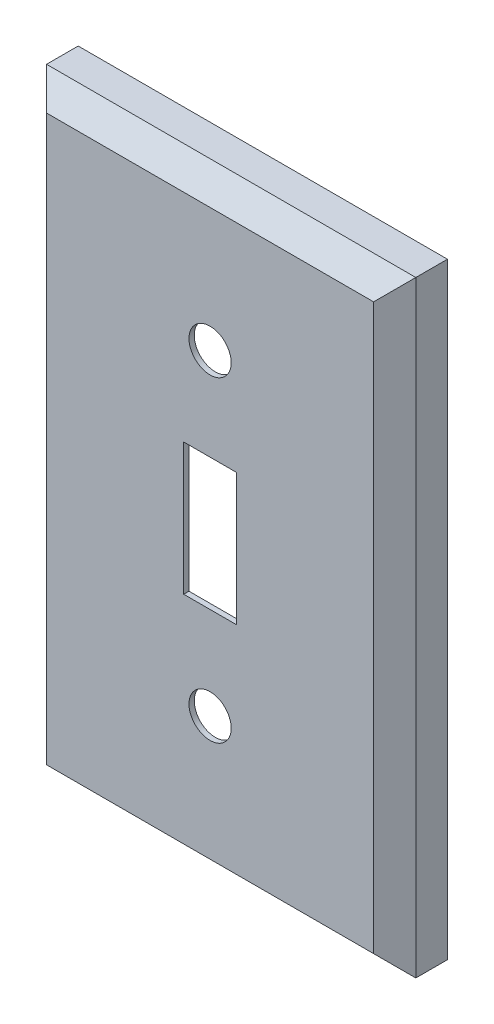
ISO-10303-21;
HEADER;
FILE_DESCRIPTION(('STEP AP214'),'2;1');
FILE_NAME('part.step','',(''),(''),'','','');
FILE_SCHEMA(('AUTOMOTIVE_DESIGN { 1 0 10303 214 1 1 1 1 }'));
ENDSEC;
DATA;
#1=APPLICATION_CONTEXT('core data for automotive mechanical design processes');
#2=APPLICATION_PROTOCOL_DEFINITION('international standard','automotive_design',2000,#1);
#3=PRODUCT_CONTEXT('',#1,'mechanical');
#4=PRODUCT('Part','Part','',(#3));
#5=PRODUCT_RELATED_PRODUCT_CATEGORY('part','',(#4));
#6=PRODUCT_DEFINITION_FORMATION('','',#4);
#7=PRODUCT_DEFINITION_CONTEXT('part definition',#1,'design');
#8=PRODUCT_DEFINITION('design','',#6,#7);
#9=PRODUCT_DEFINITION_SHAPE('','',#8);
#10=(LENGTH_UNIT() NAMED_UNIT(*) SI_UNIT(.MILLI.,.METRE.));
#11=(NAMED_UNIT(*) PLANE_ANGLE_UNIT() SI_UNIT($,.RADIAN.));
#12=(NAMED_UNIT(*) SI_UNIT($,.STERADIAN.) SOLID_ANGLE_UNIT());
#13=UNCERTAINTY_MEASURE_WITH_UNIT(LENGTH_MEASURE(1.E-05),#10,'distance_accuracy_value','');
#14=(GEOMETRIC_REPRESENTATION_CONTEXT(3) GLOBAL_UNCERTAINTY_ASSIGNED_CONTEXT((#13)) GLOBAL_UNIT_ASSIGNED_CONTEXT((#10,
#11,#12)) REPRESENTATION_CONTEXT('',''));
#15=CARTESIAN_POINT('',(0.,0.,0.));
#16=DIRECTION('',(0.,0.,1.));
#17=DIRECTION('',(1.,0.,0.));
#18=AXIS2_PLACEMENT_3D('',#15,#16,#17);
#19=CARTESIAN_POINT('',(0.,115.,0.));
#20=DIRECTION('',(0.,0.,-1.));
#21=DIRECTION('',(-1.,0.,0.));
#22=AXIS2_PLACEMENT_3D('',#19,#20,#21);
#23=PLANE('',#22);
#24=DIRECTION('',(0.,-1.,0.));
#25=VECTOR('',#24,1.);
#26=CARTESIAN_POINT('',(0.,0.,0.));
#27=LINE('',#26,#25);
#28=CARTESIAN_POINT('',(0.,115.,0.));
#29=VERTEX_POINT('',#28);
#30=CARTESIAN_POINT('',(0.,0.,0.));
#31=VERTEX_POINT('',#30);
#32=EDGE_CURVE('E229',#29,#31,#27,.T.);
#33=ORIENTED_EDGE('',*,*,#32,.F.);
#34=DIRECTION('',(-1.,0.,0.));
#35=VECTOR('',#34,1.);
#36=CARTESIAN_POINT('',(0.,115.,0.));
#37=LINE('',#36,#35);
#38=CARTESIAN_POINT('',(70.,115.,0.));
#39=VERTEX_POINT('',#38);
#40=EDGE_CURVE('E239',#39,#29,#37,.T.);
#41=ORIENTED_EDGE('',*,*,#40,.F.);
#42=DIRECTION('',(0.,1.,0.));
#43=VECTOR('',#42,1.);
#44=CARTESIAN_POINT('',(70.,0.,0.));
#45=LINE('',#44,#43);
#46=CARTESIAN_POINT('',(70.,0.,0.));
#47=VERTEX_POINT('',#46);
#48=EDGE_CURVE('E236',#47,#39,#45,.T.);
#49=ORIENTED_EDGE('',*,*,#48,.F.);
#50=DIRECTION('',(1.,0.,0.));
#51=VECTOR('',#50,1.);
#52=CARTESIAN_POINT('',(0.,0.,0.));
#53=LINE('',#52,#51);
#54=EDGE_CURVE('E232',#31,#47,#53,.T.);
#55=ORIENTED_EDGE('',*,*,#54,.F.);
#56=EDGE_LOOP('',(#33,#41,#49,#55));
#57=FACE_BOUND('',#56,.T.);
#58=DIRECTION('',(-1.,0.,0.));
#59=VECTOR('',#58,1.);
#60=CARTESIAN_POINT('',(0.,114.,0.));
#61=LINE('',#60,#59);
#62=CARTESIAN_POINT('',(69.,114.,0.));
#63=VERTEX_POINT('',#62);
#64=CARTESIAN_POINT('',(1.,114.,0.));
#65=VERTEX_POINT('',#64);
#66=EDGE_CURVE('E191',#63,#65,#61,.T.);
#67=ORIENTED_EDGE('',*,*,#66,.T.);
#68=DIRECTION('',(0.,-1.,0.));
#69=VECTOR('',#68,1.);
#70=CARTESIAN_POINT('',(1.,115.,0.));
#71=LINE('',#70,#69);
#72=CARTESIAN_POINT('',(1.,1.,0.));
#73=VERTEX_POINT('',#72);
#74=EDGE_CURVE('E205',#65,#73,#71,.T.);
#75=ORIENTED_EDGE('',*,*,#74,.T.);
#76=DIRECTION('',(1.,0.,0.));
#77=VECTOR('',#76,1.);
#78=CARTESIAN_POINT('',(0.,1.,0.));
#79=LINE('',#78,#77);
#80=CARTESIAN_POINT('',(69.,1.,0.));
#81=VERTEX_POINT('',#80);
#82=EDGE_CURVE('E221',#73,#81,#79,.T.);
#83=ORIENTED_EDGE('',*,*,#82,.T.);
#84=DIRECTION('',(0.,1.,0.));
#85=VECTOR('',#84,1.);
#86=CARTESIAN_POINT('',(69.,115.,0.));
#87=LINE('',#86,#85);
#88=EDGE_CURVE('E224',#81,#63,#87,.T.);
#89=ORIENTED_EDGE('',*,*,#88,.T.);
#90=EDGE_LOOP('',(#67,#75,#83,#89));
#91=FACE_BOUND('',#90,.T.);
#92=ADVANCED_FACE('F32',(#57,#91),#23,.T.);
#93=CARTESIAN_POINT('',(0.,0.,10.));
#94=DIRECTION('',(1.,0.,0.));
#95=DIRECTION('',(0.,0.,-1.));
#96=AXIS2_PLACEMENT_3D('',#93,#94,#95);
#97=PLANE('',#96);
#98=DIRECTION('',(0.,0.,-1.));
#99=VECTOR('',#98,1.);
#100=CARTESIAN_POINT('',(0.,0.,10.));
#101=LINE('',#100,#99);
#102=CARTESIAN_POINT('',(0.,0.,5.99999999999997));
#103=VERTEX_POINT('',#102);
#104=EDGE_CURVE('E248',#103,#31,#101,.T.);
#105=ORIENTED_EDGE('',*,*,#104,.F.);
#106=DIRECTION('',(0.,1.,0.));
#107=VECTOR('',#106,1.);
#108=CARTESIAN_POINT('',(0.,0.,5.99999999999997));
#109=LINE('',#108,#107);
#110=CARTESIAN_POINT('',(0.,115.,5.99999999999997));
#111=VERTEX_POINT('',#110);
#112=EDGE_CURVE('E266',#103,#111,#109,.T.);
#113=ORIENTED_EDGE('',*,*,#112,.T.);
#114=DIRECTION('',(0.,0.,-1.));
#115=VECTOR('',#114,1.);
#116=CARTESIAN_POINT('',(0.,115.,10.));
#117=LINE('',#116,#115);
#118=EDGE_CURVE('E242',#111,#29,#117,.T.);
#119=ORIENTED_EDGE('',*,*,#118,.T.);
#120=ORIENTED_EDGE('',*,*,#32,.T.);
#121=EDGE_LOOP('',(#105,#113,#119,#120));
#122=FACE_BOUND('',#121,.T.);
#123=ADVANCED_FACE('F298',(#122),#97,.F.);
#124=CARTESIAN_POINT('',(0.,0.,10.));
#125=DIRECTION('',(0.,1.,0.));
#126=DIRECTION('',(0.,0.,1.));
#127=AXIS2_PLACEMENT_3D('',#124,#125,#126);
#128=PLANE('',#127);
#129=DIRECTION('',(0.,0.,-1.));
#130=VECTOR('',#129,1.);
#131=CARTESIAN_POINT('',(70.,0.,10.));
#132=LINE('',#131,#130);
#133=CARTESIAN_POINT('',(70.,0.,5.99999999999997));
#134=VERTEX_POINT('',#133);
#135=EDGE_CURVE('E246',#134,#47,#132,.T.);
#136=ORIENTED_EDGE('',*,*,#135,.F.);
#137=DIRECTION('',(-1.,0.,0.));
#138=VECTOR('',#137,1.);
#139=CARTESIAN_POINT('',(0.,0.,5.99999999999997));
#140=LINE('',#139,#138);
#141=EDGE_CURVE('E264',#134,#103,#140,.T.);
#142=ORIENTED_EDGE('',*,*,#141,.T.);
#143=ORIENTED_EDGE('',*,*,#104,.T.);
#144=ORIENTED_EDGE('',*,*,#54,.T.);
#145=EDGE_LOOP('',(#136,#142,#143,#144));
#146=FACE_BOUND('',#145,.T.);
#147=ADVANCED_FACE('F304',(#146),#128,.F.);
#148=CARTESIAN_POINT('',(70.,0.,10.));
#149=DIRECTION('',(-1.,0.,0.));
#150=DIRECTION('',(0.,0.,1.));
#151=AXIS2_PLACEMENT_3D('',#148,#149,#150);
#152=PLANE('',#151);
#153=DIRECTION('',(0.,0.,-1.));
#154=VECTOR('',#153,1.);
#155=CARTESIAN_POINT('',(70.,115.,10.));
#156=LINE('',#155,#154);
#157=CARTESIAN_POINT('',(70.,115.,5.99999999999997));
#158=VERTEX_POINT('',#157);
#159=EDGE_CURVE('E244',#158,#39,#156,.T.);
#160=ORIENTED_EDGE('',*,*,#159,.F.);
#161=DIRECTION('',(0.,-1.,0.));
#162=VECTOR('',#161,1.);
#163=CARTESIAN_POINT('',(70.,0.,5.99999999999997));
#164=LINE('',#163,#162);
#165=EDGE_CURVE('E262',#158,#134,#164,.T.);
#166=ORIENTED_EDGE('',*,*,#165,.T.);
#167=ORIENTED_EDGE('',*,*,#135,.T.);
#168=ORIENTED_EDGE('',*,*,#48,.T.);
#169=EDGE_LOOP('',(#160,#166,#167,#168));
#170=FACE_BOUND('',#169,.T.);
#171=ADVANCED_FACE('F315',(#170),#152,.F.);
#172=CARTESIAN_POINT('',(0.,115.,10.));
#173=DIRECTION('',(0.,-1.,0.));
#174=DIRECTION('',(0.,0.,-1.));
#175=AXIS2_PLACEMENT_3D('',#172,#173,#174);
#176=PLANE('',#175);
#177=ORIENTED_EDGE('',*,*,#118,.F.);
#178=DIRECTION('',(1.,0.,0.));
#179=VECTOR('',#178,1.);
#180=CARTESIAN_POINT('',(0.,115.,5.99999999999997));
#181=LINE('',#180,#179);
#182=EDGE_CURVE('E259',#111,#158,#181,.T.);
#183=ORIENTED_EDGE('',*,*,#182,.T.);
#184=ORIENTED_EDGE('',*,*,#159,.T.);
#185=ORIENTED_EDGE('',*,*,#40,.T.);
#186=EDGE_LOOP('',(#177,#183,#184,#185));
#187=FACE_BOUND('',#186,.T.);
#188=ADVANCED_FACE('F312',(#187),#176,.F.);
#189=CARTESIAN_POINT('',(0.,115.,10.));
#190=DIRECTION('',(0.,0.,-1.));
#191=DIRECTION('',(-1.,0.,0.));
#192=AXIS2_PLACEMENT_3D('',#189,#190,#191);
#193=PLANE('',#192);
#194=CARTESIAN_POINT('',(35.,27.5,10.));
#195=DIRECTION('',(0.,0.,-1.));
#196=DIRECTION('',(-1.,0.,0.));
#197=AXIS2_PLACEMENT_3D('',#194,#195,#196);
#198=CIRCLE('',#197,4.);
#199=CARTESIAN_POINT('',(31.,27.5,10.));
#200=VERTEX_POINT('',#199);
#201=EDGE_CURVE('E364',#200,#200,#198,.T.);
#202=ORIENTED_EDGE('',*,*,#201,.T.);
#203=EDGE_LOOP('',(#202));
#204=FACE_BOUND('',#203,.T.);
#205=CARTESIAN_POINT('',(35.,87.5,10.));
#206=DIRECTION('',(0.,0.,-1.));
#207=DIRECTION('',(-1.,0.,0.));
#208=AXIS2_PLACEMENT_3D('',#205,#206,#207);
#209=CIRCLE('',#208,4.00000000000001);
#210=CARTESIAN_POINT('',(31.,87.5,10.));
#211=VERTEX_POINT('',#210);
#212=EDGE_CURVE('E167',#211,#211,#209,.T.);
#213=ORIENTED_EDGE('',*,*,#212,.T.);
#214=EDGE_LOOP('',(#213));
#215=FACE_BOUND('',#214,.T.);
#216=DIRECTION('',(-1.,0.,0.));
#217=VECTOR('',#216,1.);
#218=CARTESIAN_POINT('',(30.,45.,10.));
#219=LINE('',#218,#217);
#220=CARTESIAN_POINT('',(40.,45.,10.));
#221=VERTEX_POINT('',#220);
#222=CARTESIAN_POINT('',(30.,45.,10.));
#223=VERTEX_POINT('',#222);
#224=EDGE_CURVE('E154',#221,#223,#219,.T.);
#225=ORIENTED_EDGE('',*,*,#224,.T.);
#226=DIRECTION('',(0.,1.,0.));
#227=VECTOR('',#226,1.);
#228=CARTESIAN_POINT('',(30.,45.,10.));
#229=LINE('',#228,#227);
#230=CARTESIAN_POINT('',(30.,70.,10.));
#231=VERTEX_POINT('',#230);
#232=EDGE_CURVE('E149',#223,#231,#229,.T.);
#233=ORIENTED_EDGE('',*,*,#232,.T.);
#234=DIRECTION('',(1.,0.,0.));
#235=VECTOR('',#234,1.);
#236=CARTESIAN_POINT('',(30.,70.,10.));
#237=LINE('',#236,#235);
#238=CARTESIAN_POINT('',(40.,70.,10.));
#239=VERTEX_POINT('',#238);
#240=EDGE_CURVE('E157',#231,#239,#237,.T.);
#241=ORIENTED_EDGE('',*,*,#240,.T.);
#242=DIRECTION('',(0.,-1.,0.));
#243=VECTOR('',#242,1.);
#244=CARTESIAN_POINT('',(40.,45.,10.));
#245=LINE('',#244,#243);
#246=EDGE_CURVE('E49',#239,#221,#245,.T.);
#247=ORIENTED_EDGE('',*,*,#246,.T.);
#248=EDGE_LOOP('',(#225,#233,#241,#247));
#249=FACE_BOUND('',#248,.T.);
#250=DIRECTION('',(0.,1.,0.));
#251=VECTOR('',#250,1.);
#252=CARTESIAN_POINT('',(65.9999999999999,115.,10.));
#253=LINE('',#252,#251);
#254=CARTESIAN_POINT('',(65.9999999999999,4.00000000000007,10.));
#255=VERTEX_POINT('',#254);
#256=CARTESIAN_POINT('',(65.9999999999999,111.,10.));
#257=VERTEX_POINT('',#256);
#258=EDGE_CURVE('E254',#255,#257,#253,.T.);
#259=ORIENTED_EDGE('',*,*,#258,.T.);
#260=DIRECTION('',(-1.,0.,0.));
#261=VECTOR('',#260,1.);
#262=CARTESIAN_POINT('',(0.,111.,10.));
#263=LINE('',#262,#261);
#264=CARTESIAN_POINT('',(4.00000000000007,111.,10.));
#265=VERTEX_POINT('',#264);
#266=EDGE_CURVE('E256',#257,#265,#263,.T.);
#267=ORIENTED_EDGE('',*,*,#266,.T.);
#268=DIRECTION('',(0.,-1.,0.));
#269=VECTOR('',#268,1.);
#270=CARTESIAN_POINT('',(4.00000000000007,115.,10.));
#271=LINE('',#270,#269);
#272=CARTESIAN_POINT('',(4.00000000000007,4.00000000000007,10.));
#273=VERTEX_POINT('',#272);
#274=EDGE_CURVE('E250',#265,#273,#271,.T.);
#275=ORIENTED_EDGE('',*,*,#274,.T.);
#276=DIRECTION('',(1.,0.,0.));
#277=VECTOR('',#276,1.);
#278=CARTESIAN_POINT('',(0.,4.00000000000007,10.));
#279=LINE('',#278,#277);
#280=EDGE_CURVE('E252',#273,#255,#279,.T.);
#281=ORIENTED_EDGE('',*,*,#280,.T.);
#282=EDGE_LOOP('',(#259,#267,#275,#281));
#283=FACE_BOUND('',#282,.T.);
#284=ADVANCED_FACE('F161',(#204,#215,#249,#283),#193,.F.);
#285=CARTESIAN_POINT('',(0.,4.00000000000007,10.));
#286=DIRECTION('',(0.,0.707106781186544,-0.707106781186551));
#287=DIRECTION('',(0.,0.707106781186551,0.707106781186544));
#288=AXIS2_PLACEMENT_3D('',#285,#286,#287);
#289=PLANE('',#288);
#290=DIRECTION('',(0.577350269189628,0.577350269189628,0.577350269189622));
#291=VECTOR('',#290,1.);
#292=CARTESIAN_POINT('',(41.0000000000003,41.0000000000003,46.9999999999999));
#293=LINE('',#292,#291);
#294=EDGE_CURVE('E272',#103,#273,#293,.T.);
#295=ORIENTED_EDGE('',*,*,#294,.F.);
#296=ORIENTED_EDGE('',*,*,#141,.F.);
#297=DIRECTION('',(-0.577350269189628,0.577350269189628,0.577350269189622));
#298=VECTOR('',#297,1.);
#299=CARTESIAN_POINT('',(43.9999999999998,26.0000000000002,31.9999999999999));
#300=LINE('',#299,#298);
#301=EDGE_CURVE('E233',#255,#134,#300,.F.);
#302=ORIENTED_EDGE('',*,*,#301,.F.);
#303=ORIENTED_EDGE('',*,*,#280,.F.);
#304=EDGE_LOOP('',(#295,#296,#302,#303));
#305=FACE_BOUND('',#304,.T.);
#306=ADVANCED_FACE('F34',(#305),#289,.F.);
#307=CARTESIAN_POINT('',(65.9999999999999,115.,10.));
#308=DIRECTION('',(-0.707106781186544,0.,-0.707106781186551));
#309=DIRECTION('',(-0.707106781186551,0.,0.707106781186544));
#310=AXIS2_PLACEMENT_3D('',#307,#308,#309);
#311=PLANE('',#310);
#312=ORIENTED_EDGE('',*,*,#301,.T.);
#313=ORIENTED_EDGE('',*,*,#165,.F.);
#314=DIRECTION('',(-0.577350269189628,-0.577350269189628,0.577350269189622));
#315=VECTOR('',#314,1.);
#316=CARTESIAN_POINT('',(67.3333333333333,112.333333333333,8.66666666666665));
#317=LINE('',#316,#315);
#318=EDGE_CURVE('E270',#257,#158,#317,.F.);
#319=ORIENTED_EDGE('',*,*,#318,.F.);
#320=ORIENTED_EDGE('',*,*,#258,.F.);
#321=EDGE_LOOP('',(#312,#313,#319,#320));
#322=FACE_BOUND('',#321,.T.);
#323=ADVANCED_FACE('F330',(#322),#311,.F.);
#324=CARTESIAN_POINT('',(4.00000000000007,115.,10.));
#325=DIRECTION('',(0.707106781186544,0.,-0.707106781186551));
#326=DIRECTION('',(-0.707106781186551,0.,-0.707106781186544));
#327=AXIS2_PLACEMENT_3D('',#324,#325,#326);
#328=PLANE('',#327);
#329=ORIENTED_EDGE('',*,*,#294,.T.);
#330=ORIENTED_EDGE('',*,*,#274,.F.);
#331=DIRECTION('',(-0.577350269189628,0.577350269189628,-0.577350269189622));
#332=VECTOR('',#331,1.);
#333=CARTESIAN_POINT('',(2.6666666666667,112.333333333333,8.66666666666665));
#334=LINE('',#333,#332);
#335=EDGE_CURVE('E186',#111,#265,#334,.F.);
#336=ORIENTED_EDGE('',*,*,#335,.F.);
#337=ORIENTED_EDGE('',*,*,#112,.F.);
#338=EDGE_LOOP('',(#329,#330,#336,#337));
#339=FACE_BOUND('',#338,.T.);
#340=ADVANCED_FACE('F327',(#339),#328,.F.);
#341=CARTESIAN_POINT('',(0.,111.,10.));
#342=DIRECTION('',(0.,-0.707106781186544,-0.707106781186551));
#343=DIRECTION('',(0.,0.707106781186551,-0.707106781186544));
#344=AXIS2_PLACEMENT_3D('',#341,#342,#343);
#345=PLANE('',#344);
#346=ORIENTED_EDGE('',*,*,#318,.T.);
#347=ORIENTED_EDGE('',*,*,#182,.F.);
#348=ORIENTED_EDGE('',*,*,#335,.T.);
#349=ORIENTED_EDGE('',*,*,#266,.F.);
#350=EDGE_LOOP('',(#346,#347,#348,#349));
#351=FACE_BOUND('',#350,.T.);
#352=ADVANCED_FACE('F323',(#351),#345,.F.);
#353=CARTESIAN_POINT('',(1.,0.,10.));
#354=DIRECTION('',(1.,0.,0.));
#355=DIRECTION('',(0.,0.,-1.));
#356=AXIS2_PLACEMENT_3D('',#353,#354,#355);
#357=PLANE('',#356);
#358=DIRECTION('',(0.,0.,-1.));
#359=VECTOR('',#358,1.);
#360=CARTESIAN_POINT('',(1.,1.,10.));
#361=LINE('',#360,#359);
#362=CARTESIAN_POINT('',(0.999999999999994,1.,5.58578643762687));
#363=VERTEX_POINT('',#362);
#364=EDGE_CURVE('E180',#363,#73,#361,.T.);
#365=ORIENTED_EDGE('',*,*,#364,.T.);
#366=ORIENTED_EDGE('',*,*,#74,.F.);
#367=DIRECTION('',(0.,0.,-1.));
#368=VECTOR('',#367,1.);
#369=CARTESIAN_POINT('',(1.,114.,10.));
#370=LINE('',#369,#368);
#371=CARTESIAN_POINT('',(1.,114.,5.58578643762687));
#372=VERTEX_POINT('',#371);
#373=EDGE_CURVE('E188',#372,#65,#370,.T.);
#374=ORIENTED_EDGE('',*,*,#373,.F.);
#375=DIRECTION('',(0.,-1.,0.));
#376=VECTOR('',#375,1.);
#377=CARTESIAN_POINT('',(1.,115.,5.58578643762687));
#378=LINE('',#377,#376);
#379=EDGE_CURVE('E184',#363,#372,#378,.F.);
#380=ORIENTED_EDGE('',*,*,#379,.F.);
#381=EDGE_LOOP('',(#365,#366,#374,#380));
#382=FACE_BOUND('',#381,.T.);
#383=ADVANCED_FACE('F326',(#382),#357,.T.);
#384=CARTESIAN_POINT('',(0.,1.,10.));
#385=DIRECTION('',(0.,1.,0.));
#386=DIRECTION('',(0.,0.,1.));
#387=AXIS2_PLACEMENT_3D('',#384,#385,#386);
#388=PLANE('',#387);
#389=DIRECTION('',(0.,0.,-1.));
#390=VECTOR('',#389,1.);
#391=CARTESIAN_POINT('',(69.,1.,10.));
#392=LINE('',#391,#390);
#393=CARTESIAN_POINT('',(69.,0.999999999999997,5.58578643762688));
#394=VERTEX_POINT('',#393);
#395=EDGE_CURVE('E183',#394,#81,#392,.T.);
#396=ORIENTED_EDGE('',*,*,#395,.T.);
#397=ORIENTED_EDGE('',*,*,#82,.F.);
#398=ORIENTED_EDGE('',*,*,#364,.F.);
#399=DIRECTION('',(1.,0.,0.));
#400=VECTOR('',#399,1.);
#401=CARTESIAN_POINT('',(0.,1.,5.58578643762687));
#402=LINE('',#401,#400);
#403=EDGE_CURVE('E187',#394,#363,#402,.F.);
#404=ORIENTED_EDGE('',*,*,#403,.F.);
#405=EDGE_LOOP('',(#396,#397,#398,#404));
#406=FACE_BOUND('',#405,.T.);
#407=ADVANCED_FACE('F486',(#406),#388,.T.);
#408=CARTESIAN_POINT('',(69.,0.,10.));
#409=DIRECTION('',(-1.,0.,0.));
#410=DIRECTION('',(0.,0.,1.));
#411=AXIS2_PLACEMENT_3D('',#408,#409,#410);
#412=PLANE('',#411);
#413=DIRECTION('',(0.,0.,-1.));
#414=VECTOR('',#413,1.);
#415=CARTESIAN_POINT('',(69.,114.,10.));
#416=LINE('',#415,#414);
#417=CARTESIAN_POINT('',(69.,114.,5.58578643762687));
#418=VERTEX_POINT('',#417);
#419=EDGE_CURVE('E190',#418,#63,#416,.T.);
#420=ORIENTED_EDGE('',*,*,#419,.T.);
#421=ORIENTED_EDGE('',*,*,#88,.F.);
#422=ORIENTED_EDGE('',*,*,#395,.F.);
#423=DIRECTION('',(0.,1.,0.));
#424=VECTOR('',#423,1.);
#425=CARTESIAN_POINT('',(69.,115.,5.58578643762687));
#426=LINE('',#425,#424);
#427=EDGE_CURVE('E195',#418,#394,#426,.F.);
#428=ORIENTED_EDGE('',*,*,#427,.F.);
#429=EDGE_LOOP('',(#420,#421,#422,#428));
#430=FACE_BOUND('',#429,.T.);
#431=ADVANCED_FACE('F476',(#430),#412,.T.);
#432=CARTESIAN_POINT('',(0.,114.,10.));
#433=DIRECTION('',(0.,-1.,0.));
#434=DIRECTION('',(0.,0.,-1.));
#435=AXIS2_PLACEMENT_3D('',#432,#433,#434);
#436=PLANE('',#435);
#437=ORIENTED_EDGE('',*,*,#373,.T.);
#438=ORIENTED_EDGE('',*,*,#66,.F.);
#439=ORIENTED_EDGE('',*,*,#419,.F.);
#440=DIRECTION('',(-1.,0.,0.));
#441=VECTOR('',#440,1.);
#442=CARTESIAN_POINT('',(0.,114.,5.58578643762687));
#443=LINE('',#442,#441);
#444=EDGE_CURVE('E198',#372,#418,#443,.F.);
#445=ORIENTED_EDGE('',*,*,#444,.F.);
#446=EDGE_LOOP('',(#437,#438,#439,#445));
#447=FACE_BOUND('',#446,.T.);
#448=ADVANCED_FACE('F377',(#447),#436,.T.);
#449=CARTESIAN_POINT('',(0.,115.,9.));
#450=DIRECTION('',(0.,0.,-1.));
#451=DIRECTION('',(-1.,0.,0.));
#452=AXIS2_PLACEMENT_3D('',#449,#450,#451);
#453=PLANE('',#452);
#454=CARTESIAN_POINT('',(35.,27.5,9.));
#455=DIRECTION('',(0.,0.,-1.));
#456=DIRECTION('',(-1.,0.,0.));
#457=AXIS2_PLACEMENT_3D('',#454,#455,#456);
#458=CIRCLE('',#457,4.);
#459=CARTESIAN_POINT('',(31.,27.5,9.));
#460=VERTEX_POINT('',#459);
#461=EDGE_CURVE('E36',#460,#460,#458,.T.);
#462=ORIENTED_EDGE('',*,*,#461,.F.);
#463=EDGE_LOOP('',(#462));
#464=FACE_BOUND('',#463,.T.);
#465=CARTESIAN_POINT('',(35.,87.5,9.));
#466=DIRECTION('',(0.,0.,-1.));
#467=DIRECTION('',(-1.,0.,0.));
#468=AXIS2_PLACEMENT_3D('',#465,#466,#467);
#469=CIRCLE('',#468,4.00000000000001);
#470=CARTESIAN_POINT('',(31.,87.5,9.));
#471=VERTEX_POINT('',#470);
#472=EDGE_CURVE('E164',#471,#471,#469,.T.);
#473=ORIENTED_EDGE('',*,*,#472,.F.);
#474=EDGE_LOOP('',(#473));
#475=FACE_BOUND('',#474,.T.);
#476=DIRECTION('',(0.,1.,0.));
#477=VECTOR('',#476,1.);
#478=CARTESIAN_POINT('',(30.,115.,9.));
#479=LINE('',#478,#477);
#480=CARTESIAN_POINT('',(30.,45.,9.));
#481=VERTEX_POINT('',#480);
#482=CARTESIAN_POINT('',(30.,70.,9.));
#483=VERTEX_POINT('',#482);
#484=EDGE_CURVE('E11',#481,#483,#479,.T.);
#485=ORIENTED_EDGE('',*,*,#484,.F.);
#486=DIRECTION('',(-1.,0.,0.));
#487=VECTOR('',#486,1.);
#488=CARTESIAN_POINT('',(0.,45.,9.));
#489=LINE('',#488,#487);
#490=CARTESIAN_POINT('',(40.,45.,9.));
#491=VERTEX_POINT('',#490);
#492=EDGE_CURVE('E41',#491,#481,#489,.T.);
#493=ORIENTED_EDGE('',*,*,#492,.F.);
#494=DIRECTION('',(0.,-1.,0.));
#495=VECTOR('',#494,1.);
#496=CARTESIAN_POINT('',(40.,115.,9.));
#497=LINE('',#496,#495);
#498=CARTESIAN_POINT('',(40.,70.,9.));
#499=VERTEX_POINT('',#498);
#500=EDGE_CURVE('E278',#499,#491,#497,.T.);
#501=ORIENTED_EDGE('',*,*,#500,.F.);
#502=DIRECTION('',(1.,0.,0.));
#503=VECTOR('',#502,1.);
#504=CARTESIAN_POINT('',(0.,70.,9.));
#505=LINE('',#504,#503);
#506=EDGE_CURVE('E268',#483,#499,#505,.T.);
#507=ORIENTED_EDGE('',*,*,#506,.F.);
#508=EDGE_LOOP('',(#485,#493,#501,#507));
#509=FACE_BOUND('',#508,.T.);
#510=DIRECTION('',(0.,-1.,0.));
#511=VECTOR('',#510,1.);
#512=CARTESIAN_POINT('',(65.5857864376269,115.,9.));
#513=LINE('',#512,#511);
#514=CARTESIAN_POINT('',(65.5857864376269,4.41421356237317,9.));
#515=VERTEX_POINT('',#514);
#516=CARTESIAN_POINT('',(65.5857864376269,110.585786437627,9.));
#517=VERTEX_POINT('',#516);
#518=EDGE_CURVE('E209',#515,#517,#513,.F.);
#519=ORIENTED_EDGE('',*,*,#518,.F.);
#520=DIRECTION('',(-1.,0.,0.));
#521=VECTOR('',#520,1.);
#522=CARTESIAN_POINT('',(0.,4.41421356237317,9.));
#523=LINE('',#522,#521);
#524=CARTESIAN_POINT('',(4.41421356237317,4.41421356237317,9.));
#525=VERTEX_POINT('',#524);
#526=EDGE_CURVE('E211',#525,#515,#523,.F.);
#527=ORIENTED_EDGE('',*,*,#526,.F.);
#528=DIRECTION('',(0.,1.,0.));
#529=VECTOR('',#528,1.);
#530=CARTESIAN_POINT('',(4.41421356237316,115.,9.));
#531=LINE('',#530,#529);
#532=CARTESIAN_POINT('',(4.41421356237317,110.585786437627,9.));
#533=VERTEX_POINT('',#532);
#534=EDGE_CURVE('E182',#533,#525,#531,.F.);
#535=ORIENTED_EDGE('',*,*,#534,.F.);
#536=DIRECTION('',(1.,0.,0.));
#537=VECTOR('',#536,1.);
#538=CARTESIAN_POINT('',(0.,110.585786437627,9.));
#539=LINE('',#538,#537);
#540=EDGE_CURVE('E201',#517,#533,#539,.F.);
#541=ORIENTED_EDGE('',*,*,#540,.F.);
#542=EDGE_LOOP('',(#519,#527,#535,#541));
#543=FACE_BOUND('',#542,.T.);
#544=ADVANCED_FACE('F285',(#464,#475,#509,#543),#453,.T.);
#545=CARTESIAN_POINT('',(0.,4.70710678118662,9.29289321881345));
#546=DIRECTION('',(0.,0.707106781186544,-0.707106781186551));
#547=DIRECTION('',(0.,0.707106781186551,0.707106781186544));
#548=AXIS2_PLACEMENT_3D('',#545,#546,#547);
#549=PLANE('',#548);
#550=DIRECTION('',(0.577350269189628,0.577350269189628,0.577350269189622));
#551=VECTOR('',#550,1.);
#552=CARTESIAN_POINT('',(41.4714045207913,41.4714045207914,46.0571909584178));
#553=LINE('',#552,#551);
#554=EDGE_CURVE('E206',#363,#525,#553,.T.);
#555=ORIENTED_EDGE('',*,*,#554,.T.);
#556=ORIENTED_EDGE('',*,*,#526,.T.);
#557=DIRECTION('',(0.577350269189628,-0.577350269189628,-0.577350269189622));
#558=VECTOR('',#557,1.);
#559=CARTESIAN_POINT('',(28.5285954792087,41.4714045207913,46.0571909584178));
#560=LINE('',#559,#558);
#561=EDGE_CURVE('E202',#515,#394,#560,.T.);
#562=ORIENTED_EDGE('',*,*,#561,.T.);
#563=ORIENTED_EDGE('',*,*,#403,.T.);
#564=EDGE_LOOP('',(#555,#556,#562,#563));
#565=FACE_BOUND('',#564,.T.);
#566=ADVANCED_FACE('F376',(#565),#549,.T.);
#567=CARTESIAN_POINT('',(65.2928932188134,115.,9.29289321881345));
#568=DIRECTION('',(-0.707106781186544,0.,-0.707106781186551));
#569=DIRECTION('',(-0.707106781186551,0.,0.707106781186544));
#570=AXIS2_PLACEMENT_3D('',#567,#568,#569);
#571=PLANE('',#570);
#572=ORIENTED_EDGE('',*,*,#561,.F.);
#573=ORIENTED_EDGE('',*,*,#518,.T.);
#574=DIRECTION('',(0.577350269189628,0.577350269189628,-0.577350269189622));
#575=VECTOR('',#574,1.);
#576=CARTESIAN_POINT('',(43.5285954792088,88.5285954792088,31.0571909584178));
#577=LINE('',#576,#575);
#578=EDGE_CURVE('E207',#517,#418,#577,.T.);
#579=ORIENTED_EDGE('',*,*,#578,.T.);
#580=ORIENTED_EDGE('',*,*,#427,.T.);
#581=EDGE_LOOP('',(#572,#573,#579,#580));
#582=FACE_BOUND('',#581,.T.);
#583=ADVANCED_FACE('F452',(#582),#571,.T.);
#584=CARTESIAN_POINT('',(4.70710678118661,115.,9.29289321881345));
#585=DIRECTION('',(0.707106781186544,0.,-0.707106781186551));
#586=DIRECTION('',(-0.707106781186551,0.,-0.707106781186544));
#587=AXIS2_PLACEMENT_3D('',#584,#585,#586);
#588=PLANE('',#587);
#589=ORIENTED_EDGE('',*,*,#554,.F.);
#590=ORIENTED_EDGE('',*,*,#379,.T.);
#591=DIRECTION('',(0.577350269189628,-0.577350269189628,0.577350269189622));
#592=VECTOR('',#591,1.);
#593=CARTESIAN_POINT('',(3.13807118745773,111.861928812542,7.72385762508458));
#594=LINE('',#593,#592);
#595=EDGE_CURVE('E175',#372,#533,#594,.T.);
#596=ORIENTED_EDGE('',*,*,#595,.T.);
#597=ORIENTED_EDGE('',*,*,#534,.T.);
#598=EDGE_LOOP('',(#589,#590,#596,#597));
#599=FACE_BOUND('',#598,.T.);
#600=ADVANCED_FACE('F443',(#599),#588,.T.);
#601=CARTESIAN_POINT('',(0.,110.292893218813,9.29289321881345));
#602=DIRECTION('',(0.,-0.707106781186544,-0.707106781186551));
#603=DIRECTION('',(0.,0.707106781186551,-0.707106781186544));
#604=AXIS2_PLACEMENT_3D('',#601,#602,#603);
#605=PLANE('',#604);
#606=ORIENTED_EDGE('',*,*,#578,.F.);
#607=ORIENTED_EDGE('',*,*,#540,.T.);
#608=ORIENTED_EDGE('',*,*,#595,.F.);
#609=ORIENTED_EDGE('',*,*,#444,.T.);
#610=EDGE_LOOP('',(#606,#607,#608,#609));
#611=FACE_BOUND('',#610,.T.);
#612=ADVANCED_FACE('F434',(#611),#605,.T.);
#613=CARTESIAN_POINT('',(30.,45.,10.));
#614=DIRECTION('',(-1.,0.,0.));
#615=DIRECTION('',(0.,0.,1.));
#616=AXIS2_PLACEMENT_3D('',#613,#614,#615);
#617=PLANE('',#616);
#618=ORIENTED_EDGE('',*,*,#484,.T.);
#619=DIRECTION('',(0.,0.,-1.));
#620=VECTOR('',#619,1.);
#621=CARTESIAN_POINT('',(30.,70.,10.));
#622=LINE('',#621,#620);
#623=EDGE_CURVE('E57',#231,#483,#622,.T.);
#624=ORIENTED_EDGE('',*,*,#623,.F.);
#625=ORIENTED_EDGE('',*,*,#232,.F.);
#626=DIRECTION('',(0.,0.,-1.));
#627=VECTOR('',#626,1.);
#628=CARTESIAN_POINT('',(30.,45.,10.));
#629=LINE('',#628,#627);
#630=EDGE_CURVE('E173',#223,#481,#629,.T.);
#631=ORIENTED_EDGE('',*,*,#630,.T.);
#632=EDGE_LOOP('',(#618,#624,#625,#631));
#633=FACE_BOUND('',#632,.T.);
#634=ADVANCED_FACE('F146',(#633),#617,.F.);
#635=CARTESIAN_POINT('',(30.,45.,10.));
#636=DIRECTION('',(0.,-1.,0.));
#637=DIRECTION('',(0.,0.,-1.));
#638=AXIS2_PLACEMENT_3D('',#635,#636,#637);
#639=PLANE('',#638);
#640=ORIENTED_EDGE('',*,*,#492,.T.);
#641=ORIENTED_EDGE('',*,*,#630,.F.);
#642=ORIENTED_EDGE('',*,*,#224,.F.);
#643=DIRECTION('',(0.,0.,-1.));
#644=VECTOR('',#643,1.);
#645=CARTESIAN_POINT('',(40.,45.,10.));
#646=LINE('',#645,#644);
#647=EDGE_CURVE('E176',#221,#491,#646,.T.);
#648=ORIENTED_EDGE('',*,*,#647,.T.);
#649=EDGE_LOOP('',(#640,#641,#642,#648));
#650=FACE_BOUND('',#649,.T.);
#651=ADVANCED_FACE('F282',(#650),#639,.F.);
#652=CARTESIAN_POINT('',(40.,45.,10.));
#653=DIRECTION('',(1.,0.,0.));
#654=DIRECTION('',(0.,1.,0.));
#655=AXIS2_PLACEMENT_3D('',#652,#653,#654);
#656=PLANE('',#655);
#657=ORIENTED_EDGE('',*,*,#500,.T.);
#658=ORIENTED_EDGE('',*,*,#647,.F.);
#659=ORIENTED_EDGE('',*,*,#246,.F.);
#660=DIRECTION('',(0.,0.,-1.));
#661=VECTOR('',#660,1.);
#662=CARTESIAN_POINT('',(40.,70.,10.));
#663=LINE('',#662,#661);
#664=EDGE_CURVE('E153',#239,#499,#663,.T.);
#665=ORIENTED_EDGE('',*,*,#664,.T.);
#666=EDGE_LOOP('',(#657,#658,#659,#665));
#667=FACE_BOUND('',#666,.T.);
#668=ADVANCED_FACE('F287',(#667),#656,.F.);
#669=CARTESIAN_POINT('',(30.,70.,10.));
#670=DIRECTION('',(0.,1.,0.));
#671=DIRECTION('',(0.,0.,1.));
#672=AXIS2_PLACEMENT_3D('',#669,#670,#671);
#673=PLANE('',#672);
#674=ORIENTED_EDGE('',*,*,#506,.T.);
#675=ORIENTED_EDGE('',*,*,#664,.F.);
#676=ORIENTED_EDGE('',*,*,#240,.F.);
#677=ORIENTED_EDGE('',*,*,#623,.T.);
#678=EDGE_LOOP('',(#674,#675,#676,#677));
#679=FACE_BOUND('',#678,.T.);
#680=ADVANCED_FACE('F158',(#679),#673,.F.);
#681=CARTESIAN_POINT('',(35.,87.5,10.));
#682=DIRECTION('',(0.,0.,-1.));
#683=DIRECTION('',(-1.,0.,0.));
#684=AXIS2_PLACEMENT_3D('',#681,#682,#683);
#685=CYLINDRICAL_SURFACE('',#684,4.00000000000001);
#686=ORIENTED_EDGE('',*,*,#472,.T.);
#687=EDGE_LOOP('',(#686));
#688=FACE_BOUND('',#687,.T.);
#689=ORIENTED_EDGE('',*,*,#212,.F.);
#690=EDGE_LOOP('',(#689));
#691=FACE_BOUND('',#690,.T.);
#692=ADVANCED_FACE('F294',(#688,#691),#685,.F.);
#693=CARTESIAN_POINT('',(35.,27.5,10.));
#694=DIRECTION('',(0.,0.,-1.));
#695=DIRECTION('',(-1.,0.,0.));
#696=AXIS2_PLACEMENT_3D('',#693,#694,#695);
#697=CYLINDRICAL_SURFACE('',#696,4.);
#698=ORIENTED_EDGE('',*,*,#461,.T.);
#699=EDGE_LOOP('',(#698));
#700=FACE_BOUND('',#699,.T.);
#701=ORIENTED_EDGE('',*,*,#201,.F.);
#702=EDGE_LOOP('',(#701));
#703=FACE_BOUND('',#702,.T.);
#704=ADVANCED_FACE('F371',(#700,#703),#697,.F.);
#705=CLOSED_SHELL('',(#92,#123,#147,#171,#188,#284,#306,#323,#340,#352,#383,#407,#431,#448,#544,
#566,#583,#600,#612,#634,#651,#668,#680,#692,#704));
#706=MANIFOLD_SOLID_BREP('B2',#705);
#707=ADVANCED_BREP_SHAPE_REPRESENTATION('',(#18,#706),#14);
#708=SHAPE_DEFINITION_REPRESENTATION(#9,#707);
ENDSEC;
END-ISO-10303-21;
